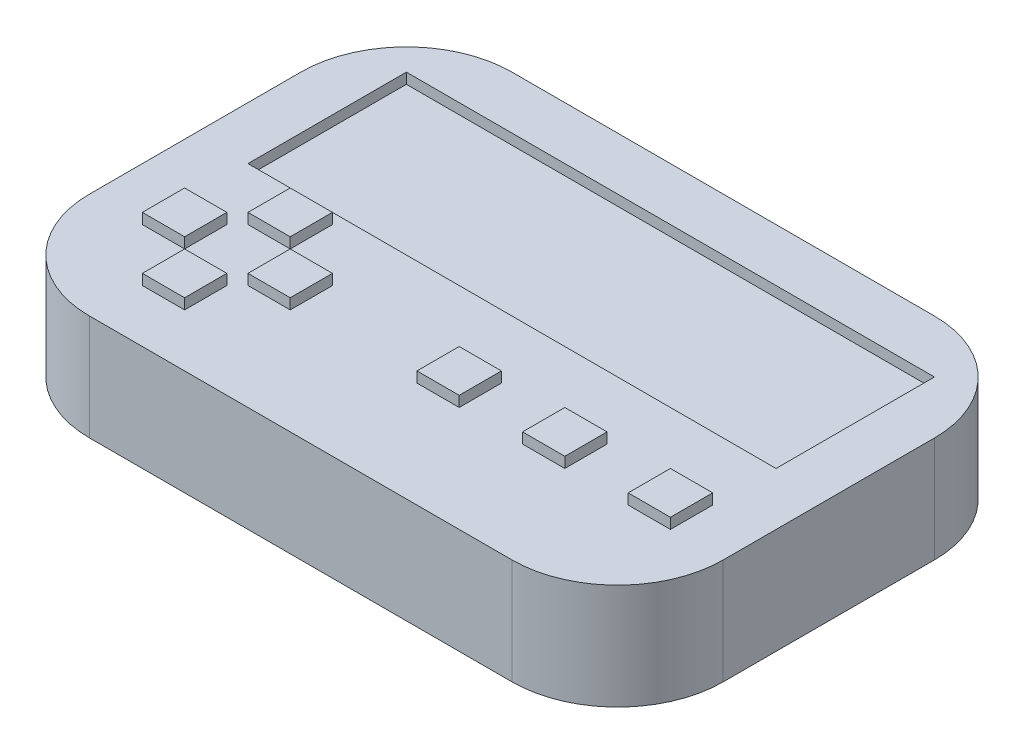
from build123d import *

# Parameters (mm, degrees)
SKETCH1_W           = 152.4
SKETCH1_H           = 101.6
BOSS_EXTRUDE1_DEPTH = 25.4
SKETCH2_W           = 127
SKETCH2_H           = 38.1
CUT_EXTRUDE1_DEPTH  = 2.54
SKETCH3_W           = 10.16
SKETCH3_H           = 10.16
BOSS_EXTRUDE2_DEPTH = 2.54
SKETCH4_W           = 10.16
SKETCH4_H           = 10.16
BOSS_EXTRUDE3_DEPTH = 2.54
FILLET1_R           = 25.4


with BuildPart() as part:
    # Sketch1 → Boss-Extrude1 (new body)
    with BuildSketch(Plane(origin=(0, 0, 0), x_dir=(1, 0, 0), z_dir=(0, 1, 0))):
        Rectangle(SKETCH1_W, SKETCH1_H)
    extrude(amount=BOSS_EXTRUDE1_DEPTH)

    # Sketch2 → Cut-Extrude1 (cut)
    with BuildSketch(Plane(origin=(0, 25.4, 0), x_dir=(1, 0, 0), z_dir=(0, 1, 0))):
        with Locations((0, 19.05)):
            Rectangle(SKETCH2_W, SKETCH2_H)
    extrude(amount=-CUT_EXTRUDE1_DEPTH, mode=Mode.SUBTRACT)

    # Sketch3 → Boss-Extrude2 (add)
    with BuildSketch(Plane(origin=(0, 25.4, 0), x_dir=(1, 0, 0), z_dir=(0, 1, 0))):
        with Locations((-45.72, -7.62)):
            Rectangle(SKETCH3_W, SKETCH3_H)
        with Locations((-45.72, -33.02)):
            Rectangle(SKETCH3_W, SKETCH3_H)
        with Locations((-33.02, -20.32)):
            Rectangle(SKETCH3_W, SKETCH3_H)
        with Locations((-58.42, -20.32)):
            Rectangle(SKETCH3_W, SKETCH3_H)
    extrude(amount=BOSS_EXTRUDE2_DEPTH)

    # Sketch4 → Boss-Extrude3 (add)
    with BuildSketch(Plane(origin=(0, 25.4, 0), x_dir=(1, 0, 0), z_dir=(0, 1, 0))):
        with Locations((33.02, -20.32)):
            Rectangle(SKETCH4_W, SKETCH4_H)
        with Locations((7.62, -20.32)):
            Rectangle(SKETCH4_W, SKETCH4_H)
        with Locations((58.42, -20.32)):
            Rectangle(SKETCH4_W, SKETCH4_H)
    extrude(amount=BOSS_EXTRUDE3_DEPTH)

    # Fillet1
    fillet1_edges = [part.edges().sort_by_distance(p)[0] for p in [
        (76.2, 12.7, 50.8),
        (-76.2, 12.7, 50.8),
        (-76.2, 12.7, -50.8),
        (76.2, 12.7, -50.8),
    ]]
    fillet(fillet1_edges, radius=FILLET1_R)


solid = part.part
